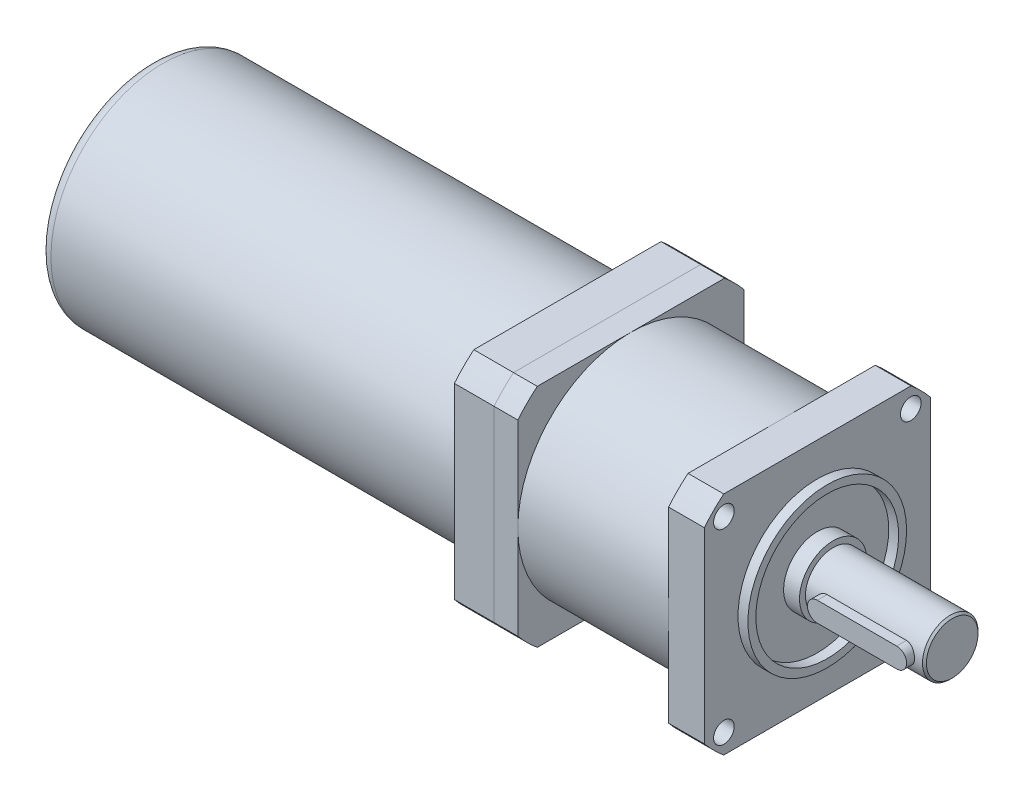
from build123d import *

# Parameters (mm, degrees)
EXTRUDE_1_DEPTH     = 9
SKETCH_2_R          = 28.5
EXTRUDE_2_DEPTH     = 38
EXTRUDE_3_DEPTH     = 6
SKETCH_6_R          = 2.6
CUT_EXTRUDE_2_DEPTH = 9
SKETCH_7_R          = 20
SKETCH_7_R_2        = 18
EXTRUDE_5_DEPTH     = 2.5
SKETCH_8_R          = 8.5
EXTRUDE_6_DEPTH     = 4
SKETCH_9_R          = 7
EXTRUDE_7_DEPTH     = 30
CUT_EXTRUDE_3_DEPTH = 3
EXTRUDE_START       = 5
EXTRUDE_8_DEPTH     = 5
CHAMFER_1_SIZE      = 0.5
EXTRUDE_9_DEPTH     = 10
SKETCH_15_R         = 28.2
EXTRUDE_10_DEPTH    = 105
FILLET_1_R          = 3


with BuildPart() as part:
    # Sketch 1 → Extrude 1 (new body)
    with BuildSketch(Plane(origin=(0, 0, 0), x_dir=(0, 0, -1), z_dir=(1, 0, 0))):
        with BuildLine():
            Line((-23.595550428, -28.5), (23.595550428, -28.5))
            ThreePointArc((23.595550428, -28.5), (26.162950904, -26.162950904), (28.5, -23.595550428))
            Line((28.5, -23.595550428), (28.5, 23.595550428))
            ThreePointArc((28.5, 23.595550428), (26.162950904, 26.162950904), (23.595550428, 28.5))
            Line((23.595550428, 28.5), (-23.595550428, 28.5))
            ThreePointArc((-23.595550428, 28.5), (-26.162950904, 26.162950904), (-28.5, 23.595550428))
            Line((-28.5, 23.595550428), (-28.5, -23.595550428))
            ThreePointArc((-28.5, -23.595550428), (-26.162950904, -26.162950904), (-23.595550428, -28.5))
        make_face()
    extrude(amount=-EXTRUDE_1_DEPTH)

    # Sketch 2 → Extrude 2 (add)
    with BuildSketch(Plane.ZY.offset(9)):
        Circle(SKETCH_2_R)
    extrude(amount=EXTRUDE_2_DEPTH)

    # Sketch 3 → Extrude 3 (add)
    with BuildSketch(Plane.ZY.offset(47)):
        with BuildLine():
            Line((-23.595550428, -28.5), (23.595550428, -28.5))
            ThreePointArc((23.595550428, -28.5), (26.162950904, -26.162950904), (28.5, -23.595550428))
            Line((28.5, -23.595550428), (28.5, 23.595550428))
            ThreePointArc((28.5, 23.595550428), (26.162950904, 26.162950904), (23.595550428, 28.5))
            Line((23.595550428, 28.5), (-23.595550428, 28.5))
            ThreePointArc((-23.595550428, 28.5), (-26.162950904, 26.162950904), (-28.5, 23.595550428))
            Line((-28.5, 23.595550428), (-28.5, -23.595550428))
            ThreePointArc((-28.5, -23.595550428), (-26.162950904, -26.162950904), (-23.595550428, -28.5))
        make_face()
    extrude(amount=EXTRUDE_3_DEPTH)

    # Sketch 6 → Cut-Extrude 2 (cut)
    with BuildSketch(Plane(origin=(0, 0, 0), x_dir=(0, 0, -1), z_dir=(1, 0, 0))):
        with Locations((-23.55, 23.55)):
            Circle(SKETCH_6_R)
        with Locations((23.55, 23.55)):
            Circle(SKETCH_6_R)
        with Locations((23.55, -23.55)):
            Circle(SKETCH_6_R)
        with Locations((-23.55, -23.55)):
            Circle(SKETCH_6_R)
    extrude(amount=-CUT_EXTRUDE_2_DEPTH, mode=Mode.SUBTRACT)

    # Sketch 7 → Extrude 5 (add)
    with BuildSketch(Plane(origin=(0, 0, 0), x_dir=(0, 0, -1), z_dir=(1, 0, 0))):
        Circle(SKETCH_7_R)
        Circle(SKETCH_7_R_2, mode=Mode.SUBTRACT)
    extrude(amount=EXTRUDE_5_DEPTH)

    # Sketch 8 → Extrude 6 (add)
    with BuildSketch(Plane(origin=(0, 0, 0), x_dir=(0, 0, -1), z_dir=(1, 0, 0))):
        Circle(SKETCH_8_R)
    extrude(amount=EXTRUDE_6_DEPTH)

    # Sketch 9 → Extrude 7 (add)
    with BuildSketch(Plane(origin=(4, 0, 0), x_dir=(0, 0, -1), z_dir=(1, 0, 0))):
        Circle(SKETCH_9_R)
    extrude(amount=EXTRUDE_7_DEPTH)

    # Sketch 10 → Cut-Extrude 3 (cut)
    with BuildSketch(Plane.XY.offset(7)):
        with BuildLine():
            Line((9, 2.5), (29, 2.5))
            ThreePointArc((29, 2.5), (31.5, 0), (29, -2.5))
            Line((29, -2.5), (9, -2.5))
            ThreePointArc((9, -2.5), (6.5, 0), (9, 2.5))
        make_face()
    extrude(amount=-CUT_EXTRUDE_3_DEPTH, mode=Mode.SUBTRACT)

    # Sketch 11 → Extrude 8 (add)
    with BuildSketch(Plane.XY.offset(4).offset(EXTRUDE_START)):
        with BuildLine():
            Line((9, 2.5), (29, 2.5))
            ThreePointArc((29, 2.5), (31.5, 0), (29, -2.5))
            Line((29, -2.5), (9, -2.5))
            ThreePointArc((9, -2.5), (6.5, 0), (9, 2.5))
        make_face()
    extrude(amount=-EXTRUDE_8_DEPTH)

    # Chamfer 1
    chamfer_1_edges = [part.edges().sort_by_distance(p)[0] for p in [
        (34, 0, 7),
    ]]
    chamfer(chamfer_1_edges, length=CHAMFER_1_SIZE)


with BuildPart() as body_2:
    # Sketch 14 → Extrude 9 (new body)
    with BuildSketch(Plane.ZY.offset(53)):
        with BuildLine():
            Line((-23.595550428, -28.5), (23.595550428, -28.5))
            ThreePointArc((23.595550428, -28.5), (26.162950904, -26.162950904), (28.5, -23.595550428))
            Line((28.5, -23.595550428), (28.5, 23.595550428))
            ThreePointArc((28.5, 23.595550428), (26.162950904, 26.162950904), (23.595550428, 28.5))
            Line((23.595550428, 28.5), (-23.595550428, 28.5))
            ThreePointArc((-23.595550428, 28.5), (-26.162950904, 26.162950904), (-28.5, 23.595550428))
            Line((-28.5, 23.595550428), (-28.5, -23.595550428))
            ThreePointArc((-28.5, -23.595550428), (-26.162950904, -26.162950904), (-23.595550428, -28.5))
        make_face()
    extrude(amount=EXTRUDE_9_DEPTH)

    # Sketch 15 → Extrude 10 (add)
    with BuildSketch(Plane.ZY.offset(63)):
        Circle(SKETCH_15_R)
    extrude(amount=EXTRUDE_10_DEPTH)

    # Fillet 1
    fillet_1_edges = [body_2.edges().sort_by_distance(p)[0] for p in [
        (-168, 0, -28.2),
    ]]
    fillet(fillet_1_edges, radius=FILLET_1_R)


solid = Compound([part.part, body_2.part])
